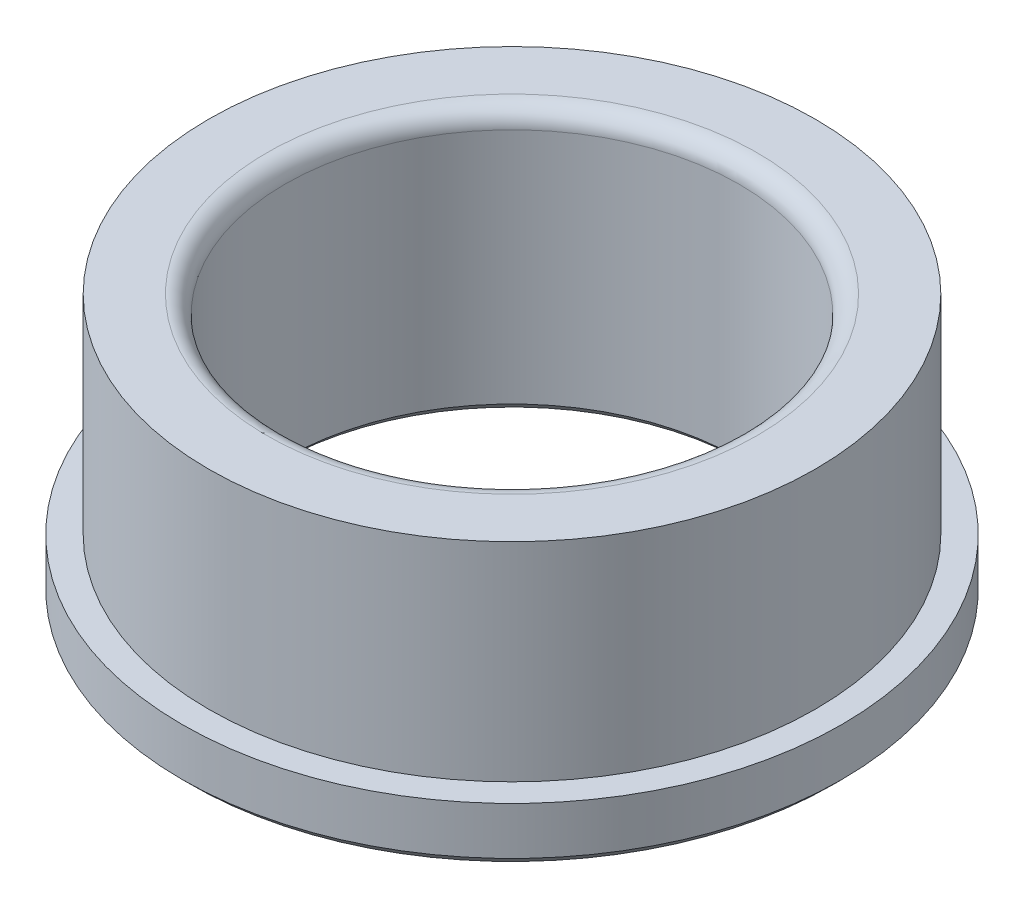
ISO-10303-21;
HEADER;
FILE_DESCRIPTION(('STEP AP214'),'2;1');
FILE_NAME('part.step','',(''),(''),'','','');
FILE_SCHEMA(('AUTOMOTIVE_DESIGN { 1 0 10303 214 1 1 1 1 }'));
ENDSEC;
DATA;
#1=APPLICATION_CONTEXT('core data for automotive mechanical design processes');
#2=APPLICATION_PROTOCOL_DEFINITION('international standard','automotive_design',2000,#1);
#3=PRODUCT_CONTEXT('',#1,'mechanical');
#4=PRODUCT('Part','Part','',(#3));
#5=PRODUCT_RELATED_PRODUCT_CATEGORY('part','',(#4));
#6=PRODUCT_DEFINITION_FORMATION('','',#4);
#7=PRODUCT_DEFINITION_CONTEXT('part definition',#1,'design');
#8=PRODUCT_DEFINITION('design','',#6,#7);
#9=PRODUCT_DEFINITION_SHAPE('','',#8);
#10=(LENGTH_UNIT() NAMED_UNIT(*) SI_UNIT(.MILLI.,.METRE.));
#11=(NAMED_UNIT(*) PLANE_ANGLE_UNIT() SI_UNIT($,.RADIAN.));
#12=(NAMED_UNIT(*) SI_UNIT($,.STERADIAN.) SOLID_ANGLE_UNIT());
#13=UNCERTAINTY_MEASURE_WITH_UNIT(LENGTH_MEASURE(1.E-05),#10,'distance_accuracy_value','');
#14=(GEOMETRIC_REPRESENTATION_CONTEXT(3) GLOBAL_UNCERTAINTY_ASSIGNED_CONTEXT((#13)) GLOBAL_UNIT_ASSIGNED_CONTEXT((#10,
#11,#12)) REPRESENTATION_CONTEXT('',''));
#15=CARTESIAN_POINT('',(0.,0.,0.));
#16=DIRECTION('',(0.,0.,1.));
#17=DIRECTION('',(1.,0.,0.));
#18=AXIS2_PLACEMENT_3D('',#15,#16,#17);
#19=CARTESIAN_POINT('',(3.49148336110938E-12,-1000.,0.));
#20=DIRECTION('',(0.,-1.,0.));
#21=DIRECTION('',(1.,0.,0.));
#22=AXIS2_PLACEMENT_3D('',#19,#20,#21);
#23=CYLINDRICAL_SURFACE('',#22,25.4634999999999);
#24=CARTESIAN_POINT('',(0.,4.7625,0.));
#25=DIRECTION('',(0.,-1.,0.));
#26=DIRECTION('',(1.,0.,0.));
#27=AXIS2_PLACEMENT_3D('',#24,#25,#26);
#28=CIRCLE('',#27,25.4635);
#29=CARTESIAN_POINT('',(25.4634999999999,4.76250000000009,0.));
#30=VERTEX_POINT('',#29);
#31=EDGE_CURVE('E39',#30,#30,#28,.T.);
#32=ORIENTED_EDGE('',*,*,#31,.F.);
#33=EDGE_LOOP('',(#32));
#34=FACE_BOUND('',#33,.T.);
#35=CARTESIAN_POINT('',(0.,22.2249999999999,0.));
#36=DIRECTION('',(0.,-1.,0.));
#37=DIRECTION('',(1.,0.,0.));
#38=AXIS2_PLACEMENT_3D('',#35,#36,#37);
#39=CIRCLE('',#38,25.4634999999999);
#40=CARTESIAN_POINT('',(25.4634999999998,22.225,0.));
#41=VERTEX_POINT('',#40);
#42=EDGE_CURVE('E60',#41,#41,#39,.T.);
#43=ORIENTED_EDGE('',*,*,#42,.T.);
#44=EDGE_LOOP('',(#43));
#45=FACE_BOUND('',#44,.T.);
#46=ADVANCED_FACE('F28',(#34,#45),#23,.T.);
#47=CARTESIAN_POINT('',(-27.686,4.7625,0.));
#48=DIRECTION('',(0.,-1.,0.));
#49=DIRECTION('',(1.,0.,0.));
#50=AXIS2_PLACEMENT_3D('',#47,#48,#49);
#51=PLANE('',#50);
#52=CARTESIAN_POINT('',(0.,4.7625,0.));
#53=DIRECTION('',(0.,-1.,0.));
#54=DIRECTION('',(1.,0.,0.));
#55=AXIS2_PLACEMENT_3D('',#52,#53,#54);
#56=CIRCLE('',#55,27.686);
#57=CARTESIAN_POINT('',(27.686,4.7625000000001,0.));
#58=VERTEX_POINT('',#57);
#59=EDGE_CURVE('E43',#58,#58,#56,.T.);
#60=ORIENTED_EDGE('',*,*,#59,.F.);
#61=EDGE_LOOP('',(#60));
#62=FACE_BOUND('',#61,.T.);
#63=ORIENTED_EDGE('',*,*,#31,.T.);
#64=EDGE_LOOP('',(#63));
#65=FACE_BOUND('',#64,.T.);
#66=ADVANCED_FACE('F77',(#62,#65),#51,.F.);
#67=CARTESIAN_POINT('',(3.49148336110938E-12,-1000.,0.));
#68=DIRECTION('',(0.,-1.,0.));
#69=DIRECTION('',(1.,0.,0.));
#70=AXIS2_PLACEMENT_3D('',#67,#68,#69);
#71=CYLINDRICAL_SURFACE('',#70,27.686);
#72=CARTESIAN_POINT('',(0.,0.761999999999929,0.));
#73=DIRECTION('',(0.,-1.,0.));
#74=DIRECTION('',(1.,0.,0.));
#75=AXIS2_PLACEMENT_3D('',#72,#73,#74);
#76=CIRCLE('',#75,27.686);
#77=CARTESIAN_POINT('',(27.686,0.762000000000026,0.));
#78=VERTEX_POINT('',#77);
#79=EDGE_CURVE('E48',#78,#78,#76,.T.);
#80=ORIENTED_EDGE('',*,*,#79,.F.);
#81=EDGE_LOOP('',(#80));
#82=FACE_BOUND('',#81,.T.);
#83=ORIENTED_EDGE('',*,*,#59,.T.);
#84=EDGE_LOOP('',(#83));
#85=FACE_BOUND('',#84,.T.);
#86=ADVANCED_FACE('F82',(#82,#85),#71,.T.);
#87=CARTESIAN_POINT('',(0.,0.761999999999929,0.));
#88=DIRECTION('',(0.,1.,0.));
#89=DIRECTION('',(-1.,0.,0.));
#90=AXIS2_PLACEMENT_3D('',#87,#88,#89);
#91=CONICAL_SURFACE('',#90,27.686,0.785398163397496);
#92=CARTESIAN_POINT('',(0.,0.,0.));
#93=DIRECTION('',(0.,-1.,0.));
#94=DIRECTION('',(1.,0.,0.));
#95=AXIS2_PLACEMENT_3D('',#92,#93,#94);
#96=CIRCLE('',#95,26.924);
#97=CARTESIAN_POINT('',(26.924,0.,0.));
#98=VERTEX_POINT('',#97);
#99=EDGE_CURVE('E51',#98,#98,#96,.T.);
#100=ORIENTED_EDGE('',*,*,#99,.F.);
#101=EDGE_LOOP('',(#100));
#102=FACE_BOUND('',#101,.T.);
#103=ORIENTED_EDGE('',*,*,#79,.T.);
#104=EDGE_LOOP('',(#103));
#105=FACE_BOUND('',#104,.T.);
#106=ADVANCED_FACE('F89',(#102,#105),#91,.T.);
#107=CARTESIAN_POINT('',(-19.81835,0.,0.));
#108=DIRECTION('',(0.,1.,0.));
#109=DIRECTION('',(-1.,0.,0.));
#110=AXIS2_PLACEMENT_3D('',#107,#108,#109);
#111=PLANE('',#110);
#112=CARTESIAN_POINT('',(0.,0.,0.));
#113=DIRECTION('',(0.,-1.,0.));
#114=DIRECTION('',(1.,0.,0.));
#115=AXIS2_PLACEMENT_3D('',#112,#113,#114);
#116=CIRCLE('',#115,19.81835);
#117=CARTESIAN_POINT('',(19.81835,0.,0.));
#118=VERTEX_POINT('',#117);
#119=EDGE_CURVE('E54',#118,#118,#116,.T.);
#120=ORIENTED_EDGE('',*,*,#119,.F.);
#121=EDGE_LOOP('',(#120));
#122=FACE_BOUND('',#121,.T.);
#123=ORIENTED_EDGE('',*,*,#99,.T.);
#124=EDGE_LOOP('',(#123));
#125=FACE_BOUND('',#124,.T.);
#126=ADVANCED_FACE('F93',(#122,#125),#111,.F.);
#127=CARTESIAN_POINT('',(0.,0.,0.));
#128=DIRECTION('',(0.,-1.,0.));
#129=DIRECTION('',(1.,0.,0.));
#130=AXIS2_PLACEMENT_3D('',#127,#128,#129);
#131=CONICAL_SURFACE('',#130,19.81835,0.785398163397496);
#132=CARTESIAN_POINT('',(0.,0.761999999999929,0.));
#133=DIRECTION('',(0.,-1.,0.));
#134=DIRECTION('',(1.,0.,0.));
#135=AXIS2_PLACEMENT_3D('',#132,#133,#134);
#136=CIRCLE('',#135,19.05635);
#137=CARTESIAN_POINT('',(19.05635,0.761999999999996,0.));
#138=VERTEX_POINT('',#137);
#139=EDGE_CURVE('E57',#138,#138,#136,.T.);
#140=ORIENTED_EDGE('',*,*,#139,.F.);
#141=EDGE_LOOP('',(#140));
#142=FACE_BOUND('',#141,.T.);
#143=ORIENTED_EDGE('',*,*,#119,.T.);
#144=EDGE_LOOP('',(#143));
#145=FACE_BOUND('',#144,.T.);
#146=ADVANCED_FACE('F74',(#142,#145),#131,.F.);
#147=CARTESIAN_POINT('',(3.49148336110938E-12,-1000.,0.));
#148=DIRECTION('',(0.,-1.,0.));
#149=DIRECTION('',(1.,0.,0.));
#150=AXIS2_PLACEMENT_3D('',#147,#148,#149);
#151=CYLINDRICAL_SURFACE('',#150,19.0563499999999);
#152=CARTESIAN_POINT('',(0.,20.7010000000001,0.));
#153=DIRECTION('',(0.,-1.,0.));
#154=DIRECTION('',(1.,0.,0.));
#155=AXIS2_PLACEMENT_3D('',#152,#153,#154);
#156=CIRCLE('',#155,19.0563499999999);
#157=CARTESIAN_POINT('',(19.0563499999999,20.7010000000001,0.));
#158=VERTEX_POINT('',#157);
#159=EDGE_CURVE('E10',#158,#158,#156,.F.);
#160=ORIENTED_EDGE('',*,*,#159,.T.);
#161=EDGE_LOOP('',(#160));
#162=FACE_BOUND('',#161,.T.);
#163=ORIENTED_EDGE('',*,*,#139,.T.);
#164=EDGE_LOOP('',(#163));
#165=FACE_BOUND('',#164,.T.);
#166=ADVANCED_FACE('F67',(#162,#165),#151,.F.);
#167=CARTESIAN_POINT('',(-25.4635,22.225,0.));
#168=DIRECTION('',(0.,-1.,0.));
#169=DIRECTION('',(1.,0.,0.));
#170=AXIS2_PLACEMENT_3D('',#167,#168,#169);
#171=PLANE('',#170);
#172=CARTESIAN_POINT('',(0.,22.2250000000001,0.));
#173=DIRECTION('',(0.,-1.,0.));
#174=DIRECTION('',(1.,0.,0.));
#175=AXIS2_PLACEMENT_3D('',#172,#173,#174);
#176=CIRCLE('',#175,20.5803499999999);
#177=CARTESIAN_POINT('',(20.5803499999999,22.2250000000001,0.));
#178=VERTEX_POINT('',#177);
#179=EDGE_CURVE('E35',#178,#178,#176,.T.);
#180=ORIENTED_EDGE('',*,*,#179,.T.);
#181=EDGE_LOOP('',(#180));
#182=FACE_BOUND('',#181,.T.);
#183=ORIENTED_EDGE('',*,*,#42,.F.);
#184=EDGE_LOOP('',(#183));
#185=FACE_BOUND('',#184,.T.);
#186=ADVANCED_FACE('F65',(#182,#185),#171,.F.);
#187=CARTESIAN_POINT('',(0.,20.7010000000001,0.));
#188=DIRECTION('',(0.,-1.,0.));
#189=DIRECTION('',(1.,0.,0.));
#190=AXIS2_PLACEMENT_3D('',#187,#188,#189);
#191=TOROIDAL_SURFACE('',#190,20.5803499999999,1.524);
#192=ORIENTED_EDGE('',*,*,#159,.F.);
#193=EDGE_LOOP('',(#192));
#194=FACE_BOUND('',#193,.T.);
#195=ORIENTED_EDGE('',*,*,#179,.F.);
#196=EDGE_LOOP('',(#195));
#197=FACE_BOUND('',#196,.T.);
#198=ADVANCED_FACE('F30',(#194,#197),#191,.T.);
#199=CLOSED_SHELL('',(#46,#66,#86,#106,#126,#146,#166,#186,#198));
#200=MANIFOLD_SOLID_BREP('B2',#199);
#201=ADVANCED_BREP_SHAPE_REPRESENTATION('',(#18,#200),#14);
#202=SHAPE_DEFINITION_REPRESENTATION(#9,#201);
ENDSEC;
END-ISO-10303-21;
